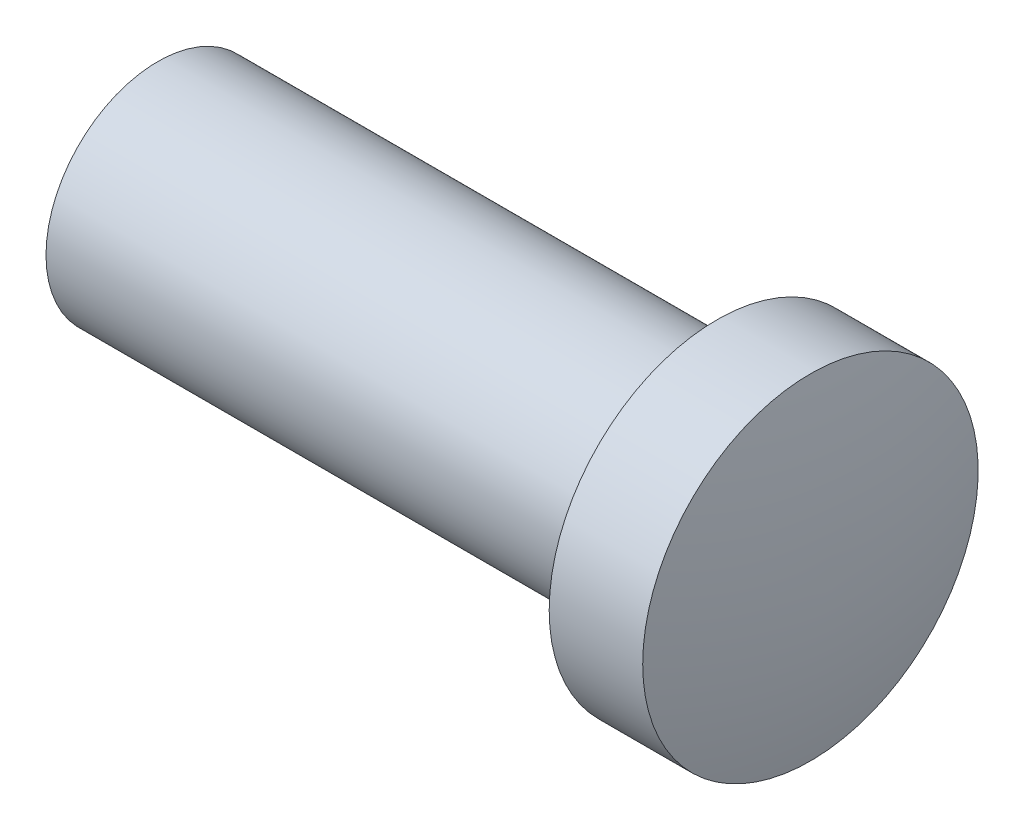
from build123d import *

# Parameters (mm, degrees)
ESQUISSE2_R             = 0.75
ENL_V_MAT_EXTRU_1_DEPTH = 5


with BuildPart() as part:
    # Esquisse1 → Base-R_volution (revolve)
    with BuildSketch(Plane.XY, mode=Mode.PRIVATE) as base_r_volution_sk:
        with BuildLine():
            Line((-68.644591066, 151.804700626), (-62.644591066, 151.804700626))
            ThreePointArc((-62.644591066, 151.804700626), (-62.682799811, 152.559463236), (-62.808289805, 153.304700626))
            Line((-62.808289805, 153.304700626), (-63.644591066, 153.304700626))
            Line((-63.644591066, 153.304700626), (-63.644591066, 152.804700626))
            Line((-63.644591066, 152.804700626), (-68.644591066, 152.804700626))
            Line((-68.644591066, 152.804700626), (-68.644591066, 151.804700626))
        make_face()
    revolve(base_r_volution_sk.sketch.rotate(Axis((-100, 151.804700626, 0), (1, 0, 0)), 90), axis=Axis((-100, 151.804700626, 0), (1, 0, 0)))

    # Esquisse2 → Enl_v. mat.-Extru.1 (cut)
    with BuildSketch(Plane.ZY.offset(68.644591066)):
        with Locations((0, 151.804700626)):
            Circle(ESQUISSE2_R)
    extrude(amount=-ENL_V_MAT_EXTRU_1_DEPTH, mode=Mode.SUBTRACT)


solid = part.part
